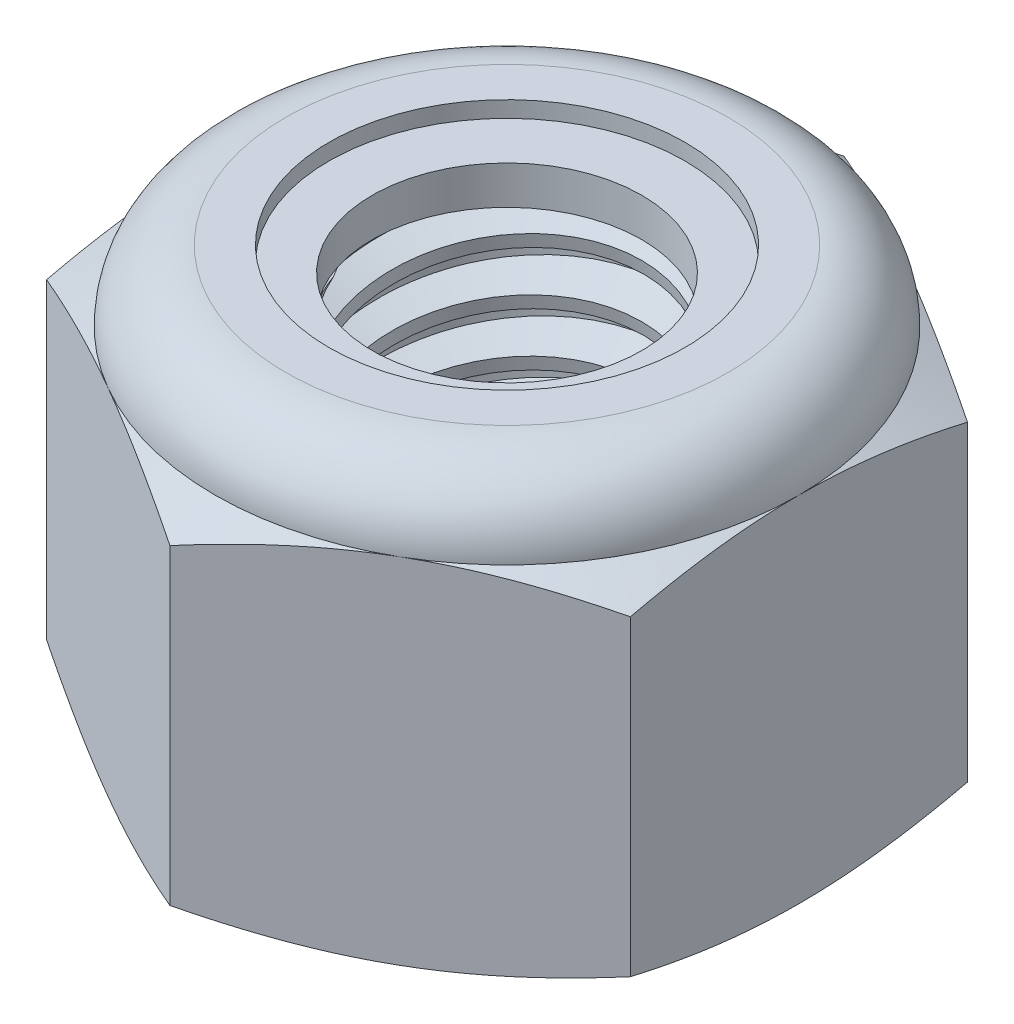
from build123d import *

# Parameters (mm, degrees)
EXTRUDE1_DEPTH      = 4
SKETCH2_W           = 1.5
SKETCH2_H           = 4
LPATTERN1_COUNT     = 8
LPATTERN1_PITCH     = 0.5
LPATTERN1_COL_COUNT = 2
LPATTERN1_COL_PITCH = 0.5


with BuildPart() as part:
    # Sketch1 → Extrude1 (new body)
    with BuildSketch(Plane(origin=(0, 0, 0), x_dir=(1, 0, 0), z_dir=(0, 1, 0))):
        Polygon((0, 3.175426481), (-2.75, 1.58771324), (-2.75, -1.58771324), (0, -3.175426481), (2.75, -1.58771324), (2.75, 1.58771324), align=None)
    extrude(amount=EXTRUDE1_DEPTH)

    # Sketch4 → Cut-Revolve2 (revolve, cut)
    with BuildSketch(Plane(origin=(0, 0, 0), x_dir=(0, 0, -1), z_dir=(1, 0, 0)), mode=Mode.PRIVATE) as cut_revolve2_sk:
        Polygon((0, 4), (1.5, 4), (1.269011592, 3.892288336), (1.269011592, 0.107711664), (1.5, 0), (0, 0), align=None)
    revolve(cut_revolve2_sk.sketch.rotate(Axis((0, 4, 0), (0, 1, 0)), 55.157981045), axis=Axis((0, 4, 0), (0, 1, 0)), mode=Mode.SUBTRACT)


with BuildPart() as body_2:
    # Sketch2 → Revolve1 (revolve)
    with BuildSketch(Plane(origin=(0, 0, 0), x_dir=(0, 0, -1), z_dir=(1, 0, 0))):
        with Locations((0.75, 2)):
            Rectangle(SKETCH2_W, SKETCH2_H)
    revolve(axis=Axis((0, -1.5, 0), (0, 1, 0)))

    # Sketch3 → Cut-Revolve1 (revolve, cut)
    with BuildSketch(Plane(origin=(0, 0, 0), x_dir=(0, 0, -1), z_dir=(1, 0, 0)), mode=Mode.PRIVATE) as cut_revolve1_sk:
        Polygon((1.510274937, 3.93835038), (1.582199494, 3.506803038), (1.289561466, 3.616435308), (1.269011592, 3.739734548), align=None)
    cut_revolve1 = revolve(cut_revolve1_sk.sketch.rotate(Axis((0, 4, 0.089188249), (0, -0.9863939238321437, -0.1643989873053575)), 180), axis=Axis((0, 4, 0.089188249), (0, -0.9863939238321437, -0.1643989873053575)), mode=Mode.SUBTRACT)

    # LPattern1: Cut-Revolve1 ×8
    with Locations(*[(0, -i * LPATTERN1_PITCH, 0) for i in range(1, LPATTERN1_COUNT)]):
        add(cut_revolve1, mode=Mode.SUBTRACT)

    # LPattern1 col: Cut-Revolve1 ×2
    with Locations(*[(0, i * LPATTERN1_COL_PITCH, 0) for i in range(1, LPATTERN1_COL_COUNT)]):
        add(cut_revolve1, mode=Mode.SUBTRACT)


with BuildPart() as part_1:
    add(part.part)

    # Combine1: cut body 2
    add(body_2.part, mode=Mode.SUBTRACT)

    # Sketch5 → Cut-Revolve3 (revolve, cut)
    with BuildSketch(Plane(origin=(0, 0, 0), x_dir=(0, 0, -1), z_dir=(1, 0, 0)), mode=Mode.PRIVATE) as cut_revolve3_sk:
        with BuildLine():
            Line((0, 0), (2.75, 0))
            Line((2.75, 0), (3.175426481, 0.198379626))
            Line((3.175426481, 0.198379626), (3.175426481, 3.134953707))
            Line((3.175426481, 3.134953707), (2.75, 3.333333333))
            ThreePointArc((2.75, 3.333333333), (2.554737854, 3.804737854), (2.083333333, 4))
            Line((2.083333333, 4), (2.083333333, 5.27))
            Line((2.083333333, 5.27), (4.445426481, 5.27))
            Line((4.445426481, 5.27), (4.445426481, -1.27))
            Line((4.445426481, -1.27), (0, -1.27))
            Line((0, -1.27), (0, 0))
        make_face()
    revolve(cut_revolve3_sk.sketch.rotate(Axis((0, 0, 0), (0, 1, 0)), 55.157981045), axis=Axis((0, 0, 0), (0, 1, 0)), mode=Mode.SUBTRACT)

    # Sketch6 → Cut-Revolve4 (revolve, cut)
    with BuildSketch(Plane(origin=(0, 0, 0), x_dir=(0, 0, -1), z_dir=(1, 0, 0)), mode=Mode.PRIVATE) as cut_revolve4_sk:
        with BuildLine():
            Line((0, 3.333333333), (2.5976, 3.333333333))
            ThreePointArc((2.5976, 3.333333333), (2.446974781, 3.696974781), (2.083333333, 3.8476))
            Line((2.083333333, 3.8476), (1.676172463, 3.8476))
            Line((1.676172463, 3.8476), (1.676172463, 5.27))
            Line((1.676172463, 5.27), (0, 5.27))
            Line((0, 5.27), (0, 3.333333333))
        make_face()
    revolve(cut_revolve4_sk.sketch.rotate(Axis((0, 5.27, 0), (0, 1, 0)), 55.157981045), axis=Axis((0, 5.27, 0), (0, 1, 0)), mode=Mode.SUBTRACT)


with BuildPart() as body_2_2:
    # Sketch7 → Revolve2 (revolve)
    with BuildSketch(Plane(origin=(0, 0, 0), x_dir=(0, 0, -1), z_dir=(1, 0, 0))):
        with BuildLine():
            Line((1.269011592, 3.409533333), (2.514721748, 3.409533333))
            ThreePointArc((2.514721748, 3.409533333), (2.36486639, 3.668954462), (2.083333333, 3.7714))
            Line((2.083333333, 3.7714), (1.269011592, 3.7714))
            Line((1.269011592, 3.7714), (1.269011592, 3.409533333))
        make_face()
    revolve(axis=Axis((0, 3.409533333, 0), (0, 1, 0)))


solid = Compound([part_1.part, body_2_2.part])
